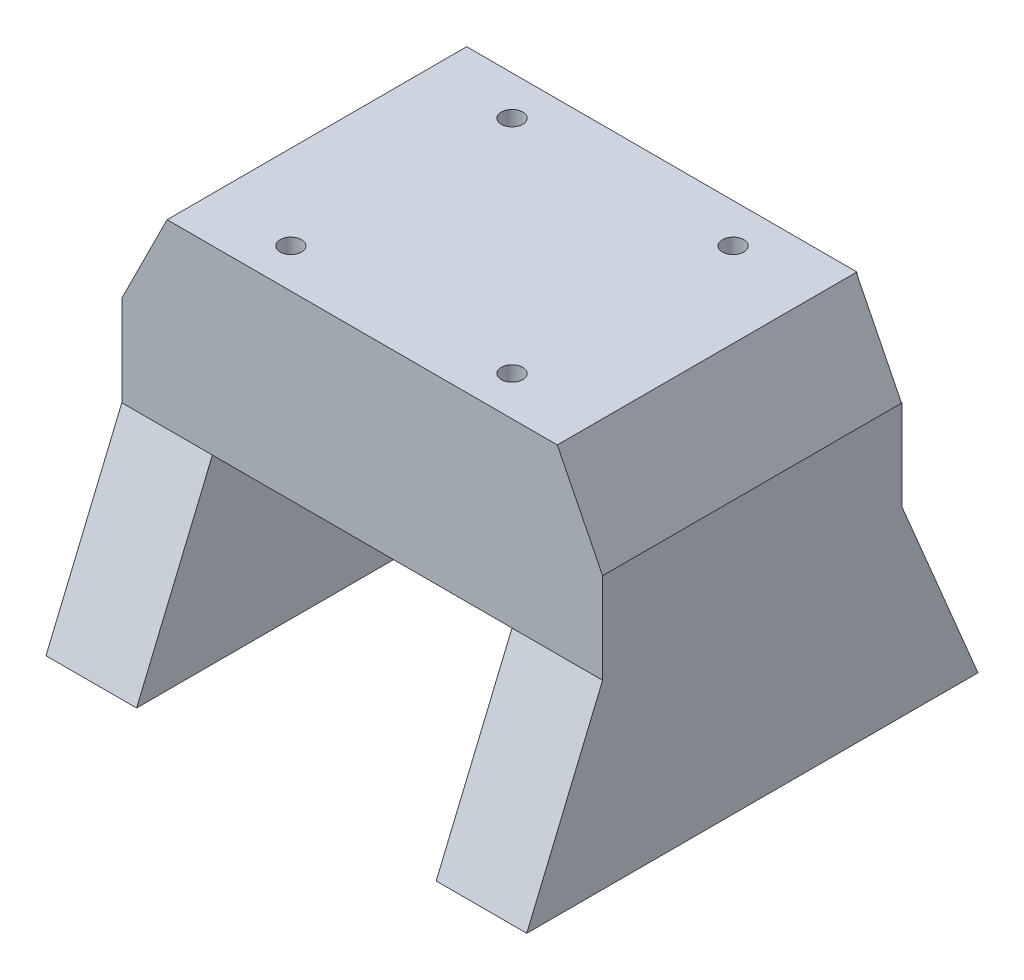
from build123d import *

# Parameters (mm, degrees)
SKETCH1_W           = 54.700000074
SKETCH1_H           = 42
SKETCH1_R           = 1.5
BOSS_EXTRUDE1_DEPTH = 25.4
SKETCH3_W           = 42
SKETCH3_H           = 12.7
BOSS_EXTRUDE4_DEPTH = 6.35
BOSS_EXTRUDE5_START = -54.700000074
SKETCH3_3_W         = 42
SKETCH3_3_H         = 12.7
BOSS_EXTRUDE5_DEPTH = 6.35
BOSS_EXTRUDE6_DEPTH = 41.91


with BuildPart() as part:
    # Sketch1 → Boss-Extrude1 (new body)
    with BuildSketch(Plane(origin=(0, 0, 0), x_dir=(1, 0, 0), z_dir=(0, 1, 0))):
        Rectangle(SKETCH1_W, SKETCH1_H)
        with Locations(Location((-15.5, 15.5, 0), (0, 0, 270))):
            Circle(SKETCH1_R, mode=Mode.SUBTRACT)
        with Locations(Location((15.5, 15.5, 0), (0, 0, 270))):
            Circle(SKETCH1_R, mode=Mode.SUBTRACT)
        with Locations(Location((15.5, -15.5, 0), (0, 0, 270))):
            Circle(SKETCH1_R, mode=Mode.SUBTRACT)
        with Locations(Location((-15.5, -15.5, 0), (0, 0, 270))):
            Circle(SKETCH1_R, mode=Mode.SUBTRACT)
    extrude(amount=BOSS_EXTRUDE1_DEPTH)

    # Sketch3 → Boss-Extrude4 (add, symmetric)
    with BuildSketch(Plane(origin=(27.350000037, 0, 0), x_dir=(0, 0, -1), z_dir=(1, 0, 0))):
        with Locations((0, 6.35)):
            Rectangle(SKETCH3_W, SKETCH3_H)
        Polygon((-31.628244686, -25.4), (31.628244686, -25.4), (21, 0), (-21, 0), align=None)
    extrude(amount=BOSS_EXTRUDE4_DEPTH, both=True)

    # Sketch3_3 → Boss-Extrude5 (add, symmetric)
    with BuildSketch(Plane(origin=(27.350000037, 0, 0), x_dir=(0, 0, -1), z_dir=(1, 0, 0)).offset(BOSS_EXTRUDE5_START)):
        Polygon((-31.628244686, -25.4), (31.628244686, -25.4), (21, 0), (-21, 0), align=None)
        with Locations((0, 6.35)):
            Rectangle(SKETCH3_3_W, SKETCH3_3_H)
    extrude(amount=BOSS_EXTRUDE5_DEPTH, both=True)

    # Sketch4 → Boss-Extrude6 (add)
    with BuildSketch(Plane.XY.offset(21)):
        Polygon((-33.700000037, 12.7), (-27.350000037, 25.4), (-27.350000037, 12.7), align=None)
        Polygon((33.700000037, 12.7), (27.350000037, 25.4), (27.350000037, 12.7), align=None)
    extrude(amount=-BOSS_EXTRUDE6_DEPTH)


solid = part.part
